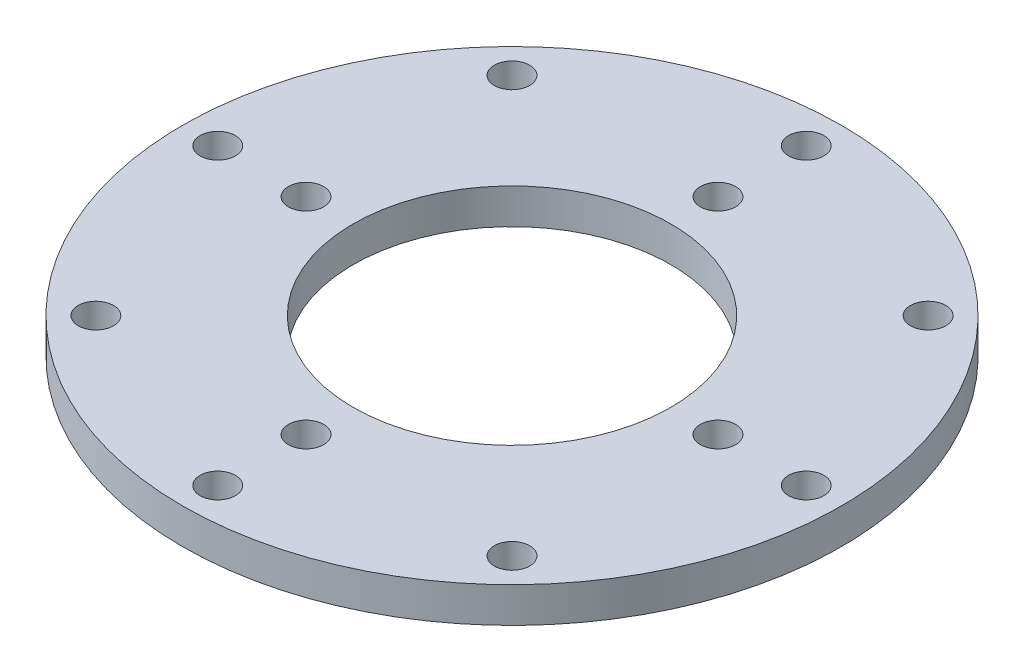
ISO-10303-21;
HEADER;
FILE_DESCRIPTION(('STEP AP214'),'2;1');
FILE_NAME('part.step','',(''),(''),'','','');
FILE_SCHEMA(('AUTOMOTIVE_DESIGN { 1 0 10303 214 1 1 1 1 }'));
ENDSEC;
DATA;
#1=APPLICATION_CONTEXT('core data for automotive mechanical design processes');
#2=APPLICATION_PROTOCOL_DEFINITION('international standard','automotive_design',2000,#1);
#3=PRODUCT_CONTEXT('',#1,'mechanical');
#4=PRODUCT('Part','Part','',(#3));
#5=PRODUCT_RELATED_PRODUCT_CATEGORY('part','',(#4));
#6=PRODUCT_DEFINITION_FORMATION('','',#4);
#7=PRODUCT_DEFINITION_CONTEXT('part definition',#1,'design');
#8=PRODUCT_DEFINITION('design','',#6,#7);
#9=PRODUCT_DEFINITION_SHAPE('','',#8);
#10=(LENGTH_UNIT() NAMED_UNIT(*) SI_UNIT(.MILLI.,.METRE.));
#11=(NAMED_UNIT(*) PLANE_ANGLE_UNIT() SI_UNIT($,.RADIAN.));
#12=(NAMED_UNIT(*) SI_UNIT($,.STERADIAN.) SOLID_ANGLE_UNIT());
#13=UNCERTAINTY_MEASURE_WITH_UNIT(LENGTH_MEASURE(1.E-05),#10,'distance_accuracy_value','');
#14=(GEOMETRIC_REPRESENTATION_CONTEXT(3) GLOBAL_UNCERTAINTY_ASSIGNED_CONTEXT((#13)) GLOBAL_UNIT_ASSIGNED_CONTEXT((#10,
#11,#12)) REPRESENTATION_CONTEXT('',''));
#15=CARTESIAN_POINT('',(0.,0.,0.));
#16=DIRECTION('',(0.,0.,1.));
#17=DIRECTION('',(1.,0.,0.));
#18=AXIS2_PLACEMENT_3D('',#15,#16,#17);
#19=CARTESIAN_POINT('',(0.,3.,0.));
#20=DIRECTION('',(0.,1.,0.));
#21=DIRECTION('',(0.,0.,1.));
#22=AXIS2_PLACEMENT_3D('',#19,#20,#21);
#23=PLANE('',#22);
#24=CARTESIAN_POINT('',(25.,3.,0.));
#25=DIRECTION('',(0.,1.,0.));
#26=DIRECTION('',(0.,0.,1.));
#27=AXIS2_PLACEMENT_3D('',#24,#25,#26);
#28=CIRCLE('',#27,1.5);
#29=CARTESIAN_POINT('',(25.,3.,1.5));
#30=VERTEX_POINT('',#29);
#31=EDGE_CURVE('E115',#30,#30,#28,.T.);
#32=ORIENTED_EDGE('',*,*,#31,.F.);
#33=EDGE_LOOP('',(#32));
#34=FACE_BOUND('',#33,.T.);
#35=CARTESIAN_POINT('',(0.,3.,-25.));
#36=DIRECTION('',(0.,1.,0.));
#37=DIRECTION('',(0.,0.,1.));
#38=AXIS2_PLACEMENT_3D('',#35,#36,#37);
#39=CIRCLE('',#38,1.5);
#40=CARTESIAN_POINT('',(0.,3.,-23.5));
#41=VERTEX_POINT('',#40);
#42=EDGE_CURVE('E103',#41,#41,#39,.T.);
#43=ORIENTED_EDGE('',*,*,#42,.F.);
#44=EDGE_LOOP('',(#43));
#45=FACE_BOUND('',#44,.T.);
#46=CARTESIAN_POINT('',(-25.,3.,0.));
#47=DIRECTION('',(0.,1.,0.));
#48=DIRECTION('',(0.,0.,1.));
#49=AXIS2_PLACEMENT_3D('',#46,#47,#48);
#50=CIRCLE('',#49,1.5);
#51=CARTESIAN_POINT('',(-25.,3.,1.5));
#52=VERTEX_POINT('',#51);
#53=EDGE_CURVE('E91',#52,#52,#50,.T.);
#54=ORIENTED_EDGE('',*,*,#53,.F.);
#55=EDGE_LOOP('',(#54));
#56=FACE_BOUND('',#55,.T.);
#57=CARTESIAN_POINT('',(17.5,3.,1.83447007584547E-13));
#58=DIRECTION('',(0.,1.,0.));
#59=DIRECTION('',(0.,0.,1.));
#60=AXIS2_PLACEMENT_3D('',#57,#58,#59);
#61=CIRCLE('',#60,1.5);
#62=CARTESIAN_POINT('',(17.5,3.,1.50000000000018));
#63=VERTEX_POINT('',#62);
#64=EDGE_CURVE('E79',#63,#63,#61,.T.);
#65=ORIENTED_EDGE('',*,*,#64,.F.);
#66=EDGE_LOOP('',(#65));
#67=FACE_BOUND('',#66,.T.);
#68=CARTESIAN_POINT('',(-17.5,3.,0.));
#69=DIRECTION('',(0.,1.,0.));
#70=DIRECTION('',(0.,0.,1.));
#71=AXIS2_PLACEMENT_3D('',#68,#69,#70);
#72=CIRCLE('',#71,1.5);
#73=CARTESIAN_POINT('',(-17.5,3.,1.49999999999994));
#74=VERTEX_POINT('',#73);
#75=EDGE_CURVE('E67',#74,#74,#72,.T.);
#76=ORIENTED_EDGE('',*,*,#75,.F.);
#77=EDGE_LOOP('',(#76));
#78=FACE_BOUND('',#77,.T.);
#79=CARTESIAN_POINT('',(0.,3.,17.5));
#80=DIRECTION('',(0.,1.,0.));
#81=DIRECTION('',(0.,0.,1.));
#82=AXIS2_PLACEMENT_3D('',#79,#80,#81);
#83=CIRCLE('',#82,1.5);
#84=CARTESIAN_POINT('',(0.,3.,19.));
#85=VERTEX_POINT('',#84);
#86=EDGE_CURVE('E55',#85,#85,#83,.T.);
#87=ORIENTED_EDGE('',*,*,#86,.F.);
#88=EDGE_LOOP('',(#87));
#89=FACE_BOUND('',#88,.T.);
#90=CARTESIAN_POINT('',(0.,3.,0.));
#91=DIRECTION('',(0.,1.,0.));
#92=DIRECTION('',(0.,0.,1.));
#93=AXIS2_PLACEMENT_3D('',#90,#91,#92);
#94=CIRCLE('',#93,28.);
#95=CARTESIAN_POINT('',(0.,3.,28.));
#96=VERTEX_POINT('',#95);
#97=EDGE_CURVE('E10',#96,#96,#94,.T.);
#98=ORIENTED_EDGE('',*,*,#97,.T.);
#99=EDGE_LOOP('',(#98));
#100=FACE_BOUND('',#99,.T.);
#101=CARTESIAN_POINT('',(0.,3.,0.));
#102=DIRECTION('',(0.,1.,0.));
#103=DIRECTION('',(0.,0.,1.));
#104=AXIS2_PLACEMENT_3D('',#101,#102,#103);
#105=CIRCLE('',#104,13.5);
#106=CARTESIAN_POINT('',(0.,3.,13.5));
#107=VERTEX_POINT('',#106);
#108=EDGE_CURVE('E50',#107,#107,#105,.T.);
#109=ORIENTED_EDGE('',*,*,#108,.F.);
#110=EDGE_LOOP('',(#109));
#111=FACE_BOUND('',#110,.T.);
#112=CARTESIAN_POINT('',(0.,3.,25.));
#113=DIRECTION('',(0.,1.,0.));
#114=DIRECTION('',(0.,0.,1.));
#115=AXIS2_PLACEMENT_3D('',#112,#113,#114);
#116=CIRCLE('',#115,1.5);
#117=CARTESIAN_POINT('',(0.,3.,26.5));
#118=VERTEX_POINT('',#117);
#119=EDGE_CURVE('E61',#118,#118,#116,.T.);
#120=ORIENTED_EDGE('',*,*,#119,.F.);
#121=EDGE_LOOP('',(#120));
#122=FACE_BOUND('',#121,.T.);
#123=CARTESIAN_POINT('',(1.2220184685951E-13,3.,-17.5));
#124=DIRECTION('',(0.,1.,0.));
#125=DIRECTION('',(0.,0.,1.));
#126=AXIS2_PLACEMENT_3D('',#123,#124,#125);
#127=CIRCLE('',#126,1.5);
#128=CARTESIAN_POINT('',(1.2220184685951E-13,3.,-16.));
#129=VERTEX_POINT('',#128);
#130=EDGE_CURVE('E73',#129,#129,#127,.T.);
#131=ORIENTED_EDGE('',*,*,#130,.F.);
#132=EDGE_LOOP('',(#131));
#133=FACE_BOUND('',#132,.T.);
#134=CARTESIAN_POINT('',(-17.6776695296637,3.,17.6776695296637));
#135=DIRECTION('',(0.,1.,0.));
#136=DIRECTION('',(0.,0.,1.));
#137=AXIS2_PLACEMENT_3D('',#134,#135,#136);
#138=CIRCLE('',#137,1.5);
#139=CARTESIAN_POINT('',(-17.6776695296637,3.,19.1776695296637));
#140=VERTEX_POINT('',#139);
#141=EDGE_CURVE('E85',#140,#140,#138,.T.);
#142=ORIENTED_EDGE('',*,*,#141,.F.);
#143=EDGE_LOOP('',(#142));
#144=FACE_BOUND('',#143,.T.);
#145=CARTESIAN_POINT('',(-17.6776695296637,3.,-17.6776695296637));
#146=DIRECTION('',(0.,1.,0.));
#147=DIRECTION('',(0.,0.,1.));
#148=AXIS2_PLACEMENT_3D('',#145,#146,#147);
#149=CIRCLE('',#148,1.5);
#150=CARTESIAN_POINT('',(-17.6776695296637,3.,-16.1776695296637));
#151=VERTEX_POINT('',#150);
#152=EDGE_CURVE('E97',#151,#151,#149,.T.);
#153=ORIENTED_EDGE('',*,*,#152,.F.);
#154=EDGE_LOOP('',(#153));
#155=FACE_BOUND('',#154,.T.);
#156=CARTESIAN_POINT('',(17.6776695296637,3.,-17.6776695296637));
#157=DIRECTION('',(0.,1.,0.));
#158=DIRECTION('',(0.,0.,1.));
#159=AXIS2_PLACEMENT_3D('',#156,#157,#158);
#160=CIRCLE('',#159,1.5);
#161=CARTESIAN_POINT('',(17.6776695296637,3.,-16.1776695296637));
#162=VERTEX_POINT('',#161);
#163=EDGE_CURVE('E109',#162,#162,#160,.T.);
#164=ORIENTED_EDGE('',*,*,#163,.F.);
#165=EDGE_LOOP('',(#164));
#166=FACE_BOUND('',#165,.T.);
#167=CARTESIAN_POINT('',(17.6776695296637,3.,17.6776695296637));
#168=DIRECTION('',(0.,1.,0.));
#169=DIRECTION('',(0.,0.,1.));
#170=AXIS2_PLACEMENT_3D('',#167,#168,#169);
#171=CIRCLE('',#170,1.5);
#172=CARTESIAN_POINT('',(17.6776695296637,3.,19.1776695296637));
#173=VERTEX_POINT('',#172);
#174=EDGE_CURVE('E121',#173,#173,#171,.T.);
#175=ORIENTED_EDGE('',*,*,#174,.F.);
#176=EDGE_LOOP('',(#175));
#177=FACE_BOUND('',#176,.T.);
#178=ADVANCED_FACE('F39',(#34,#45,#56,#67,#78,#89,#100,#111,#122,#133,#144,#155,#166,#177),#23,.T.);
#179=CARTESIAN_POINT('',(0.,0.,0.));
#180=DIRECTION('',(0.,1.,0.));
#181=DIRECTION('',(0.,0.,1.));
#182=AXIS2_PLACEMENT_3D('',#179,#180,#181);
#183=PLANE('',#182);
#184=CARTESIAN_POINT('',(0.,0.,0.));
#185=DIRECTION('',(0.,1.,0.));
#186=DIRECTION('',(0.,0.,1.));
#187=AXIS2_PLACEMENT_3D('',#184,#185,#186);
#188=CIRCLE('',#187,28.);
#189=CARTESIAN_POINT('',(0.,0.,28.));
#190=VERTEX_POINT('',#189);
#191=EDGE_CURVE('E43',#190,#190,#188,.T.);
#192=ORIENTED_EDGE('',*,*,#191,.F.);
#193=EDGE_LOOP('',(#192));
#194=FACE_BOUND('',#193,.T.);
#195=CARTESIAN_POINT('',(0.,0.,0.));
#196=DIRECTION('',(0.,1.,0.));
#197=DIRECTION('',(0.,0.,1.));
#198=AXIS2_PLACEMENT_3D('',#195,#196,#197);
#199=CIRCLE('',#198,13.5);
#200=CARTESIAN_POINT('',(0.,0.,13.5));
#201=VERTEX_POINT('',#200);
#202=EDGE_CURVE('E52',#201,#201,#199,.T.);
#203=ORIENTED_EDGE('',*,*,#202,.T.);
#204=EDGE_LOOP('',(#203));
#205=FACE_BOUND('',#204,.T.);
#206=CARTESIAN_POINT('',(0.,0.,17.5));
#207=DIRECTION('',(0.,1.,0.));
#208=DIRECTION('',(0.,0.,1.));
#209=AXIS2_PLACEMENT_3D('',#206,#207,#208);
#210=CIRCLE('',#209,1.5);
#211=CARTESIAN_POINT('',(0.,0.,19.));
#212=VERTEX_POINT('',#211);
#213=EDGE_CURVE('E58',#212,#212,#210,.T.);
#214=ORIENTED_EDGE('',*,*,#213,.T.);
#215=EDGE_LOOP('',(#214));
#216=FACE_BOUND('',#215,.T.);
#217=CARTESIAN_POINT('',(0.,0.,25.));
#218=DIRECTION('',(0.,1.,0.));
#219=DIRECTION('',(0.,0.,1.));
#220=AXIS2_PLACEMENT_3D('',#217,#218,#219);
#221=CIRCLE('',#220,1.5);
#222=CARTESIAN_POINT('',(0.,0.,26.5));
#223=VERTEX_POINT('',#222);
#224=EDGE_CURVE('E64',#223,#223,#221,.T.);
#225=ORIENTED_EDGE('',*,*,#224,.T.);
#226=EDGE_LOOP('',(#225));
#227=FACE_BOUND('',#226,.T.);
#228=CARTESIAN_POINT('',(-17.5,0.,0.));
#229=DIRECTION('',(0.,1.,0.));
#230=DIRECTION('',(0.,0.,1.));
#231=AXIS2_PLACEMENT_3D('',#228,#229,#230);
#232=CIRCLE('',#231,1.5);
#233=CARTESIAN_POINT('',(-17.5,0.,1.49999999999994));
#234=VERTEX_POINT('',#233);
#235=EDGE_CURVE('E70',#234,#234,#232,.T.);
#236=ORIENTED_EDGE('',*,*,#235,.T.);
#237=EDGE_LOOP('',(#236));
#238=FACE_BOUND('',#237,.T.);
#239=CARTESIAN_POINT('',(1.2220184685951E-13,0.,-17.5));
#240=DIRECTION('',(0.,1.,0.));
#241=DIRECTION('',(0.,0.,1.));
#242=AXIS2_PLACEMENT_3D('',#239,#240,#241);
#243=CIRCLE('',#242,1.5);
#244=CARTESIAN_POINT('',(1.2220184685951E-13,0.,-16.));
#245=VERTEX_POINT('',#244);
#246=EDGE_CURVE('E76',#245,#245,#243,.T.);
#247=ORIENTED_EDGE('',*,*,#246,.T.);
#248=EDGE_LOOP('',(#247));
#249=FACE_BOUND('',#248,.T.);
#250=CARTESIAN_POINT('',(17.5,0.,1.83447007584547E-13));
#251=DIRECTION('',(0.,1.,0.));
#252=DIRECTION('',(0.,0.,1.));
#253=AXIS2_PLACEMENT_3D('',#250,#251,#252);
#254=CIRCLE('',#253,1.5);
#255=CARTESIAN_POINT('',(17.5,0.,1.50000000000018));
#256=VERTEX_POINT('',#255);
#257=EDGE_CURVE('E82',#256,#256,#254,.T.);
#258=ORIENTED_EDGE('',*,*,#257,.T.);
#259=EDGE_LOOP('',(#258));
#260=FACE_BOUND('',#259,.T.);
#261=CARTESIAN_POINT('',(-17.6776695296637,0.,17.6776695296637));
#262=DIRECTION('',(0.,1.,0.));
#263=DIRECTION('',(0.,0.,1.));
#264=AXIS2_PLACEMENT_3D('',#261,#262,#263);
#265=CIRCLE('',#264,1.5);
#266=CARTESIAN_POINT('',(-17.6776695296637,0.,19.1776695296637));
#267=VERTEX_POINT('',#266);
#268=EDGE_CURVE('E88',#267,#267,#265,.T.);
#269=ORIENTED_EDGE('',*,*,#268,.T.);
#270=EDGE_LOOP('',(#269));
#271=FACE_BOUND('',#270,.T.);
#272=CARTESIAN_POINT('',(-25.,0.,0.));
#273=DIRECTION('',(0.,1.,0.));
#274=DIRECTION('',(0.,0.,1.));
#275=AXIS2_PLACEMENT_3D('',#272,#273,#274);
#276=CIRCLE('',#275,1.5);
#277=CARTESIAN_POINT('',(-25.,0.,1.5));
#278=VERTEX_POINT('',#277);
#279=EDGE_CURVE('E94',#278,#278,#276,.T.);
#280=ORIENTED_EDGE('',*,*,#279,.T.);
#281=EDGE_LOOP('',(#280));
#282=FACE_BOUND('',#281,.T.);
#283=CARTESIAN_POINT('',(-17.6776695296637,0.,-17.6776695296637));
#284=DIRECTION('',(0.,1.,0.));
#285=DIRECTION('',(0.,0.,1.));
#286=AXIS2_PLACEMENT_3D('',#283,#284,#285);
#287=CIRCLE('',#286,1.5);
#288=CARTESIAN_POINT('',(-17.6776695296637,0.,-16.1776695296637));
#289=VERTEX_POINT('',#288);
#290=EDGE_CURVE('E100',#289,#289,#287,.T.);
#291=ORIENTED_EDGE('',*,*,#290,.T.);
#292=EDGE_LOOP('',(#291));
#293=FACE_BOUND('',#292,.T.);
#294=CARTESIAN_POINT('',(0.,0.,-25.));
#295=DIRECTION('',(0.,1.,0.));
#296=DIRECTION('',(0.,0.,1.));
#297=AXIS2_PLACEMENT_3D('',#294,#295,#296);
#298=CIRCLE('',#297,1.5);
#299=CARTESIAN_POINT('',(0.,0.,-23.5));
#300=VERTEX_POINT('',#299);
#301=EDGE_CURVE('E106',#300,#300,#298,.T.);
#302=ORIENTED_EDGE('',*,*,#301,.T.);
#303=EDGE_LOOP('',(#302));
#304=FACE_BOUND('',#303,.T.);
#305=CARTESIAN_POINT('',(17.6776695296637,0.,-17.6776695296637));
#306=DIRECTION('',(0.,1.,0.));
#307=DIRECTION('',(0.,0.,1.));
#308=AXIS2_PLACEMENT_3D('',#305,#306,#307);
#309=CIRCLE('',#308,1.5);
#310=CARTESIAN_POINT('',(17.6776695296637,0.,-16.1776695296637));
#311=VERTEX_POINT('',#310);
#312=EDGE_CURVE('E112',#311,#311,#309,.T.);
#313=ORIENTED_EDGE('',*,*,#312,.T.);
#314=EDGE_LOOP('',(#313));
#315=FACE_BOUND('',#314,.T.);
#316=CARTESIAN_POINT('',(25.,0.,0.));
#317=DIRECTION('',(0.,1.,0.));
#318=DIRECTION('',(0.,0.,1.));
#319=AXIS2_PLACEMENT_3D('',#316,#317,#318);
#320=CIRCLE('',#319,1.5);
#321=CARTESIAN_POINT('',(25.,0.,1.5));
#322=VERTEX_POINT('',#321);
#323=EDGE_CURVE('E118',#322,#322,#320,.T.);
#324=ORIENTED_EDGE('',*,*,#323,.T.);
#325=EDGE_LOOP('',(#324));
#326=FACE_BOUND('',#325,.T.);
#327=CARTESIAN_POINT('',(17.6776695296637,0.,17.6776695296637));
#328=DIRECTION('',(0.,1.,0.));
#329=DIRECTION('',(0.,0.,1.));
#330=AXIS2_PLACEMENT_3D('',#327,#328,#329);
#331=CIRCLE('',#330,1.5);
#332=CARTESIAN_POINT('',(17.6776695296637,0.,19.1776695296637));
#333=VERTEX_POINT('',#332);
#334=EDGE_CURVE('E124',#333,#333,#331,.T.);
#335=ORIENTED_EDGE('',*,*,#334,.T.);
#336=EDGE_LOOP('',(#335));
#337=FACE_BOUND('',#336,.T.);
#338=ADVANCED_FACE('F134',(#194,#205,#216,#227,#238,#249,#260,#271,#282,#293,#304,#315,#326,
#337),#183,.F.);
#339=CARTESIAN_POINT('',(0.,3.,0.));
#340=DIRECTION('',(0.,-1.,0.));
#341=DIRECTION('',(0.,0.,-1.));
#342=AXIS2_PLACEMENT_3D('',#339,#340,#341);
#343=CYLINDRICAL_SURFACE('',#342,28.);
#344=ORIENTED_EDGE('',*,*,#97,.F.);
#345=EDGE_LOOP('',(#344));
#346=FACE_BOUND('',#345,.T.);
#347=ORIENTED_EDGE('',*,*,#191,.T.);
#348=EDGE_LOOP('',(#347));
#349=FACE_BOUND('',#348,.T.);
#350=ADVANCED_FACE('F41',(#346,#349),#343,.T.);
#351=CARTESIAN_POINT('',(0.,3.,0.));
#352=DIRECTION('',(0.,-1.,0.));
#353=DIRECTION('',(0.,0.,-1.));
#354=AXIS2_PLACEMENT_3D('',#351,#352,#353);
#355=CYLINDRICAL_SURFACE('',#354,13.5);
#356=ORIENTED_EDGE('',*,*,#108,.T.);
#357=EDGE_LOOP('',(#356));
#358=FACE_BOUND('',#357,.T.);
#359=ORIENTED_EDGE('',*,*,#202,.F.);
#360=EDGE_LOOP('',(#359));
#361=FACE_BOUND('',#360,.T.);
#362=ADVANCED_FACE('F144',(#358,#361),#355,.F.);
#363=CARTESIAN_POINT('',(0.,3.,17.5));
#364=DIRECTION('',(0.,-1.,0.));
#365=DIRECTION('',(0.,0.,-1.));
#366=AXIS2_PLACEMENT_3D('',#363,#364,#365);
#367=CYLINDRICAL_SURFACE('',#366,1.5);
#368=ORIENTED_EDGE('',*,*,#86,.T.);
#369=EDGE_LOOP('',(#368));
#370=FACE_BOUND('',#369,.T.);
#371=ORIENTED_EDGE('',*,*,#213,.F.);
#372=EDGE_LOOP('',(#371));
#373=FACE_BOUND('',#372,.T.);
#374=ADVANCED_FACE('F147',(#370,#373),#367,.F.);
#375=CARTESIAN_POINT('',(0.,3.,25.));
#376=DIRECTION('',(0.,-1.,0.));
#377=DIRECTION('',(0.,0.,-1.));
#378=AXIS2_PLACEMENT_3D('',#375,#376,#377);
#379=CYLINDRICAL_SURFACE('',#378,1.5);
#380=ORIENTED_EDGE('',*,*,#119,.T.);
#381=EDGE_LOOP('',(#380));
#382=FACE_BOUND('',#381,.T.);
#383=ORIENTED_EDGE('',*,*,#224,.F.);
#384=EDGE_LOOP('',(#383));
#385=FACE_BOUND('',#384,.T.);
#386=ADVANCED_FACE('F151',(#382,#385),#379,.F.);
#387=CARTESIAN_POINT('',(-17.5,3.,0.));
#388=DIRECTION('',(0.,-1.,0.));
#389=DIRECTION('',(0.,0.,-1.));
#390=AXIS2_PLACEMENT_3D('',#387,#388,#389);
#391=CYLINDRICAL_SURFACE('',#390,1.5);
#392=ORIENTED_EDGE('',*,*,#75,.T.);
#393=EDGE_LOOP('',(#392));
#394=FACE_BOUND('',#393,.T.);
#395=ORIENTED_EDGE('',*,*,#235,.F.);
#396=EDGE_LOOP('',(#395));
#397=FACE_BOUND('',#396,.T.);
#398=ADVANCED_FACE('F155',(#394,#397),#391,.F.);
#399=CARTESIAN_POINT('',(1.2220184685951E-13,3.,-17.5));
#400=DIRECTION('',(0.,-1.,0.));
#401=DIRECTION('',(0.,0.,-1.));
#402=AXIS2_PLACEMENT_3D('',#399,#400,#401);
#403=CYLINDRICAL_SURFACE('',#402,1.5);
#404=ORIENTED_EDGE('',*,*,#130,.T.);
#405=EDGE_LOOP('',(#404));
#406=FACE_BOUND('',#405,.T.);
#407=ORIENTED_EDGE('',*,*,#246,.F.);
#408=EDGE_LOOP('',(#407));
#409=FACE_BOUND('',#408,.T.);
#410=ADVANCED_FACE('F159',(#406,#409),#403,.F.);
#411=CARTESIAN_POINT('',(17.5,3.,1.83447007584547E-13));
#412=DIRECTION('',(0.,-1.,0.));
#413=DIRECTION('',(0.,0.,-1.));
#414=AXIS2_PLACEMENT_3D('',#411,#412,#413);
#415=CYLINDRICAL_SURFACE('',#414,1.5);
#416=ORIENTED_EDGE('',*,*,#64,.T.);
#417=EDGE_LOOP('',(#416));
#418=FACE_BOUND('',#417,.T.);
#419=ORIENTED_EDGE('',*,*,#257,.F.);
#420=EDGE_LOOP('',(#419));
#421=FACE_BOUND('',#420,.T.);
#422=ADVANCED_FACE('F163',(#418,#421),#415,.F.);
#423=CARTESIAN_POINT('',(-17.6776695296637,3.,17.6776695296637));
#424=DIRECTION('',(0.,-1.,0.));
#425=DIRECTION('',(0.,0.,-1.));
#426=AXIS2_PLACEMENT_3D('',#423,#424,#425);
#427=CYLINDRICAL_SURFACE('',#426,1.5);
#428=ORIENTED_EDGE('',*,*,#141,.T.);
#429=EDGE_LOOP('',(#428));
#430=FACE_BOUND('',#429,.T.);
#431=ORIENTED_EDGE('',*,*,#268,.F.);
#432=EDGE_LOOP('',(#431));
#433=FACE_BOUND('',#432,.T.);
#434=ADVANCED_FACE('F167',(#430,#433),#427,.F.);
#435=CARTESIAN_POINT('',(-25.,3.,0.));
#436=DIRECTION('',(0.,-1.,0.));
#437=DIRECTION('',(0.,0.,-1.));
#438=AXIS2_PLACEMENT_3D('',#435,#436,#437);
#439=CYLINDRICAL_SURFACE('',#438,1.5);
#440=ORIENTED_EDGE('',*,*,#53,.T.);
#441=EDGE_LOOP('',(#440));
#442=FACE_BOUND('',#441,.T.);
#443=ORIENTED_EDGE('',*,*,#279,.F.);
#444=EDGE_LOOP('',(#443));
#445=FACE_BOUND('',#444,.T.);
#446=ADVANCED_FACE('F171',(#442,#445),#439,.F.);
#447=CARTESIAN_POINT('',(-17.6776695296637,3.,-17.6776695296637));
#448=DIRECTION('',(0.,-1.,0.));
#449=DIRECTION('',(0.,0.,-1.));
#450=AXIS2_PLACEMENT_3D('',#447,#448,#449);
#451=CYLINDRICAL_SURFACE('',#450,1.5);
#452=ORIENTED_EDGE('',*,*,#152,.T.);
#453=EDGE_LOOP('',(#452));
#454=FACE_BOUND('',#453,.T.);
#455=ORIENTED_EDGE('',*,*,#290,.F.);
#456=EDGE_LOOP('',(#455));
#457=FACE_BOUND('',#456,.T.);
#458=ADVANCED_FACE('F175',(#454,#457),#451,.F.);
#459=CARTESIAN_POINT('',(0.,3.,-25.));
#460=DIRECTION('',(0.,-1.,0.));
#461=DIRECTION('',(0.,0.,-1.));
#462=AXIS2_PLACEMENT_3D('',#459,#460,#461);
#463=CYLINDRICAL_SURFACE('',#462,1.5);
#464=ORIENTED_EDGE('',*,*,#42,.T.);
#465=EDGE_LOOP('',(#464));
#466=FACE_BOUND('',#465,.T.);
#467=ORIENTED_EDGE('',*,*,#301,.F.);
#468=EDGE_LOOP('',(#467));
#469=FACE_BOUND('',#468,.T.);
#470=ADVANCED_FACE('F179',(#466,#469),#463,.F.);
#471=CARTESIAN_POINT('',(17.6776695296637,3.,-17.6776695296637));
#472=DIRECTION('',(0.,-1.,0.));
#473=DIRECTION('',(0.,0.,-1.));
#474=AXIS2_PLACEMENT_3D('',#471,#472,#473);
#475=CYLINDRICAL_SURFACE('',#474,1.5);
#476=ORIENTED_EDGE('',*,*,#163,.T.);
#477=EDGE_LOOP('',(#476));
#478=FACE_BOUND('',#477,.T.);
#479=ORIENTED_EDGE('',*,*,#312,.F.);
#480=EDGE_LOOP('',(#479));
#481=FACE_BOUND('',#480,.T.);
#482=ADVANCED_FACE('F183',(#478,#481),#475,.F.);
#483=CARTESIAN_POINT('',(25.,3.,0.));
#484=DIRECTION('',(0.,-1.,0.));
#485=DIRECTION('',(0.,0.,-1.));
#486=AXIS2_PLACEMENT_3D('',#483,#484,#485);
#487=CYLINDRICAL_SURFACE('',#486,1.5);
#488=ORIENTED_EDGE('',*,*,#31,.T.);
#489=EDGE_LOOP('',(#488));
#490=FACE_BOUND('',#489,.T.);
#491=ORIENTED_EDGE('',*,*,#323,.F.);
#492=EDGE_LOOP('',(#491));
#493=FACE_BOUND('',#492,.T.);
#494=ADVANCED_FACE('F187',(#490,#493),#487,.F.);
#495=CARTESIAN_POINT('',(17.6776695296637,3.,17.6776695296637));
#496=DIRECTION('',(0.,-1.,0.));
#497=DIRECTION('',(0.,0.,-1.));
#498=AXIS2_PLACEMENT_3D('',#495,#496,#497);
#499=CYLINDRICAL_SURFACE('',#498,1.5);
#500=ORIENTED_EDGE('',*,*,#174,.T.);
#501=EDGE_LOOP('',(#500));
#502=FACE_BOUND('',#501,.T.);
#503=ORIENTED_EDGE('',*,*,#334,.F.);
#504=EDGE_LOOP('',(#503));
#505=FACE_BOUND('',#504,.T.);
#506=ADVANCED_FACE('F130',(#502,#505),#499,.F.);
#507=CLOSED_SHELL('',(#178,#338,#350,#362,#374,#386,#398,#410,#422,#434,#446,#458,#470,#482,
#494,#506));
#508=MANIFOLD_SOLID_BREP('B2',#507);
#509=ADVANCED_BREP_SHAPE_REPRESENTATION('',(#18,#508),#14);
#510=SHAPE_DEFINITION_REPRESENTATION(#9,#509);
ENDSEC;
END-ISO-10303-21;
